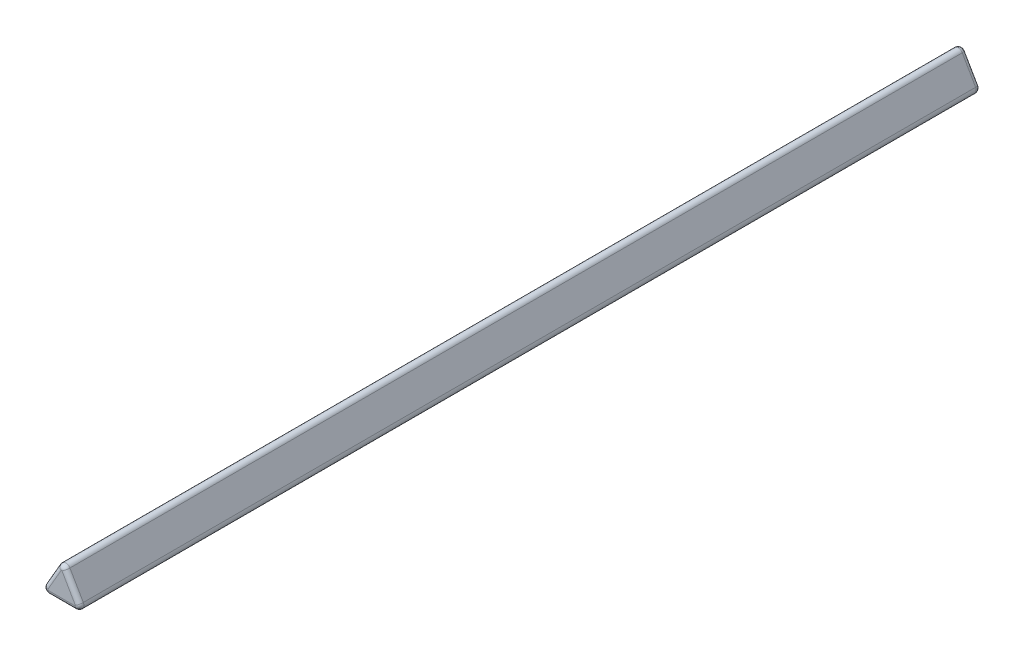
ISO-10303-21;
HEADER;
FILE_DESCRIPTION(('STEP AP214'),'2;1');
FILE_NAME('part.step','',(''),(''),'','','');
FILE_SCHEMA(('AUTOMOTIVE_DESIGN { 1 0 10303 214 1 1 1 1 }'));
ENDSEC;
DATA;
#1=APPLICATION_CONTEXT('core data for automotive mechanical design processes');
#2=APPLICATION_PROTOCOL_DEFINITION('international standard','automotive_design',2000,#1);
#3=PRODUCT_CONTEXT('',#1,'mechanical');
#4=PRODUCT('Part','Part','',(#3));
#5=PRODUCT_RELATED_PRODUCT_CATEGORY('part','',(#4));
#6=PRODUCT_DEFINITION_FORMATION('','',#4);
#7=PRODUCT_DEFINITION_CONTEXT('part definition',#1,'design');
#8=PRODUCT_DEFINITION('design','',#6,#7);
#9=PRODUCT_DEFINITION_SHAPE('','',#8);
#10=(LENGTH_UNIT() NAMED_UNIT(*) SI_UNIT(.MILLI.,.METRE.));
#11=(NAMED_UNIT(*) PLANE_ANGLE_UNIT() SI_UNIT($,.RADIAN.));
#12=(NAMED_UNIT(*) SI_UNIT($,.STERADIAN.) SOLID_ANGLE_UNIT());
#13=UNCERTAINTY_MEASURE_WITH_UNIT(LENGTH_MEASURE(1.E-05),#10,'distance_accuracy_value','');
#14=(GEOMETRIC_REPRESENTATION_CONTEXT(3) GLOBAL_UNCERTAINTY_ASSIGNED_CONTEXT((#13)) GLOBAL_UNIT_ASSIGNED_CONTEXT((#10,
#11,#12)) REPRESENTATION_CONTEXT('',''));
#15=CARTESIAN_POINT('',(0.,0.,0.));
#16=DIRECTION('',(0.,0.,1.));
#17=DIRECTION('',(1.,0.,0.));
#18=AXIS2_PLACEMENT_3D('',#15,#16,#17);
#19=CARTESIAN_POINT('',(1.55884581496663,-0.900000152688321,105.));
#20=DIRECTION('',(0.,0.,-1.));
#21=DIRECTION('',(-1.,0.,0.));
#22=AXIS2_PLACEMENT_3D('',#19,#20,#21);
#23=CYLINDRICAL_SURFACE('',#22,0.549999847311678);
#24=DIRECTION('',(0.,0.,-1.));
#25=VECTOR('',#24,1.);
#26=CARTESIAN_POINT('',(2.03515965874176,-0.625000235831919,105.));
#27=LINE('',#26,#25);
#28=CARTESIAN_POINT('',(2.03515965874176,-0.625000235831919,104.5));
#29=VERTEX_POINT('',#28);
#30=CARTESIAN_POINT('',(2.03515965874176,-0.625000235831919,0.5));
#31=VERTEX_POINT('',#30);
#32=EDGE_CURVE('E134',#29,#31,#27,.T.);
#33=ORIENTED_EDGE('',*,*,#32,.F.);
#34=CARTESIAN_POINT('',(1.55884581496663,-0.900000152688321,104.5));
#35=DIRECTION('',(0.,0.,1.));
#36=DIRECTION('',(1.,0.,0.));
#37=AXIS2_PLACEMENT_3D('',#34,#35,#36);
#38=CIRCLE('',#37,0.549999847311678);
#39=CARTESIAN_POINT('',(1.55884581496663,-1.45,104.5));
#40=VERTEX_POINT('',#39);
#41=EDGE_CURVE('E167',#29,#40,#38,.F.);
#42=ORIENTED_EDGE('',*,*,#41,.T.);
#43=DIRECTION('',(0.,0.,-1.));
#44=VECTOR('',#43,1.);
#45=CARTESIAN_POINT('',(1.55884581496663,-1.45,105.));
#46=LINE('',#45,#44);
#47=CARTESIAN_POINT('',(1.55884581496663,-1.45,0.5));
#48=VERTEX_POINT('',#47);
#49=EDGE_CURVE('E219',#40,#48,#46,.T.);
#50=ORIENTED_EDGE('',*,*,#49,.T.);
#51=CARTESIAN_POINT('',(1.55884581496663,-0.900000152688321,0.5));
#52=DIRECTION('',(0.,0.,1.));
#53=DIRECTION('',(1.,0.,0.));
#54=AXIS2_PLACEMENT_3D('',#51,#52,#53);
#55=CIRCLE('',#54,0.549999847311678);
#56=EDGE_CURVE('E165',#48,#31,#55,.T.);
#57=ORIENTED_EDGE('',*,*,#56,.T.);
#58=EDGE_LOOP('',(#33,#42,#50,#57));
#59=FACE_BOUND('',#58,.T.);
#60=ADVANCED_FACE('F27',(#59),#23,.T.);
#61=CARTESIAN_POINT('',(2.03515965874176,-0.625000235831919,105.));
#62=DIRECTION('',(-0.866025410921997,-0.499999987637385,0.));
#63=DIRECTION('',(0.499999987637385,-0.866025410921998,0.));
#64=AXIS2_PLACEMENT_3D('',#61,#62,#63);
#65=PLANE('',#64);
#66=DIRECTION('',(0.,0.,-1.));
#67=VECTOR('',#66,1.);
#68=CARTESIAN_POINT('',(0.476313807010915,2.07500006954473,105.));
#69=LINE('',#68,#67);
#70=CARTESIAN_POINT('',(0.476313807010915,2.07500006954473,104.5));
#71=VERTEX_POINT('',#70);
#72=CARTESIAN_POINT('',(0.476313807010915,2.07500006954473,0.5));
#73=VERTEX_POINT('',#72);
#74=EDGE_CURVE('E231',#71,#73,#69,.T.);
#75=ORIENTED_EDGE('',*,*,#74,.F.);
#76=DIRECTION('',(-0.499999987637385,0.866025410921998,0.));
#77=VECTOR('',#76,1.);
#78=CARTESIAN_POINT('',(2.03515965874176,-0.625000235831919,104.5));
#79=LINE('',#78,#77);
#80=EDGE_CURVE('E163',#71,#29,#79,.F.);
#81=ORIENTED_EDGE('',*,*,#80,.T.);
#82=ORIENTED_EDGE('',*,*,#32,.T.);
#83=DIRECTION('',(-0.499999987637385,0.866025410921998,0.));
#84=VECTOR('',#83,1.);
#85=CARTESIAN_POINT('',(2.03515965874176,-0.625000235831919,0.5));
#86=LINE('',#85,#84);
#87=EDGE_CURVE('E160',#31,#73,#86,.T.);
#88=ORIENTED_EDGE('',*,*,#87,.T.);
#89=EDGE_LOOP('',(#75,#81,#82,#88));
#90=FACE_BOUND('',#89,.T.);
#91=ADVANCED_FACE('F270',(#90),#65,.F.);
#92=CARTESIAN_POINT('',(-3.67642200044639E-08,1.80000015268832,105.));
#93=DIRECTION('',(0.,0.,-1.));
#94=DIRECTION('',(-1.,0.,0.));
#95=AXIS2_PLACEMENT_3D('',#92,#93,#94);
#96=CYLINDRICAL_SURFACE('',#95,0.549999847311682);
#97=DIRECTION('',(0.,0.,-1.));
#98=VECTOR('',#97,1.);
#99=CARTESIAN_POINT('',(-0.47631388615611,2.07500005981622,105.));
#100=LINE('',#99,#98);
#101=CARTESIAN_POINT('',(-0.47631388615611,2.07500005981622,104.5));
#102=VERTEX_POINT('',#101);
#103=CARTESIAN_POINT('',(-0.47631388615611,2.07500005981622,0.5));
#104=VERTEX_POINT('',#103);
#105=EDGE_CURVE('E228',#102,#104,#100,.T.);
#106=ORIENTED_EDGE('',*,*,#105,.F.);
#107=CARTESIAN_POINT('',(-3.67642200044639E-08,1.80000015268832,104.5));
#108=DIRECTION('',(0.,0.,1.));
#109=DIRECTION('',(1.,0.,0.));
#110=AXIS2_PLACEMENT_3D('',#107,#108,#109);
#111=CIRCLE('',#110,0.549999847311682);
#112=EDGE_CURVE('E158',#102,#71,#111,.F.);
#113=ORIENTED_EDGE('',*,*,#112,.T.);
#114=ORIENTED_EDGE('',*,*,#74,.T.);
#115=CARTESIAN_POINT('',(-3.67642200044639E-08,1.80000015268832,0.5));
#116=DIRECTION('',(0.,0.,1.));
#117=DIRECTION('',(1.,0.,0.));
#118=AXIS2_PLACEMENT_3D('',#115,#116,#117);
#119=CIRCLE('',#118,0.549999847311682);
#120=EDGE_CURVE('E156',#73,#104,#119,.T.);
#121=ORIENTED_EDGE('',*,*,#120,.T.);
#122=EDGE_LOOP('',(#106,#113,#114,#121));
#123=FACE_BOUND('',#122,.T.);
#124=ADVANCED_FACE('F260',(#123),#96,.T.);
#125=CARTESIAN_POINT('',(-0.47631388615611,2.07500005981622,105.));
#126=DIRECTION('',(0.86602542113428,-0.499999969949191,0.));
#127=DIRECTION('',(0.499999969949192,0.86602542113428,0.));
#128=AXIS2_PLACEMENT_3D('',#125,#126,#127);
#129=PLANE('',#128);
#130=DIRECTION('',(0.,0.,-1.));
#131=VECTOR('',#130,1.);
#132=CARTESIAN_POINT('',(-2.03515966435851,-0.625000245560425,105.));
#133=LINE('',#132,#131);
#134=CARTESIAN_POINT('',(-2.03515966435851,-0.625000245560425,104.5));
#135=VERTEX_POINT('',#134);
#136=CARTESIAN_POINT('',(-2.03515966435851,-0.625000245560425,0.5));
#137=VERTEX_POINT('',#136);
#138=EDGE_CURVE('E225',#135,#137,#133,.T.);
#139=ORIENTED_EDGE('',*,*,#138,.F.);
#140=DIRECTION('',(-0.499999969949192,-0.86602542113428,0.));
#141=VECTOR('',#140,1.);
#142=CARTESIAN_POINT('',(-0.47631388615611,2.07500005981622,104.5));
#143=LINE('',#142,#141);
#144=EDGE_CURVE('E154',#135,#102,#143,.F.);
#145=ORIENTED_EDGE('',*,*,#144,.T.);
#146=ORIENTED_EDGE('',*,*,#105,.T.);
#147=DIRECTION('',(-0.499999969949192,-0.86602542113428,0.));
#148=VECTOR('',#147,1.);
#149=CARTESIAN_POINT('',(-0.47631388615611,2.07500005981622,0.5));
#150=LINE('',#149,#148);
#151=EDGE_CURVE('E152',#104,#137,#150,.T.);
#152=ORIENTED_EDGE('',*,*,#151,.T.);
#153=EDGE_LOOP('',(#139,#145,#146,#152));
#154=FACE_BOUND('',#153,.T.);
#155=ADVANCED_FACE('F256',(#154),#129,.F.);
#156=CARTESIAN_POINT('',(-1.55884581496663,-0.900000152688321,105.));
#157=DIRECTION('',(0.,0.,-1.));
#158=DIRECTION('',(-1.,0.,0.));
#159=AXIS2_PLACEMENT_3D('',#156,#157,#158);
#160=CYLINDRICAL_SURFACE('',#159,0.549999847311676);
#161=DIRECTION('',(0.,0.,-1.));
#162=VECTOR('',#161,1.);
#163=CARTESIAN_POINT('',(-1.55884581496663,-1.45,105.));
#164=LINE('',#163,#162);
#165=CARTESIAN_POINT('',(-1.55884581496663,-1.45,104.5));
#166=VERTEX_POINT('',#165);
#167=CARTESIAN_POINT('',(-1.55884581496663,-1.45,0.5));
#168=VERTEX_POINT('',#167);
#169=EDGE_CURVE('E222',#166,#168,#164,.T.);
#170=ORIENTED_EDGE('',*,*,#169,.F.);
#171=CARTESIAN_POINT('',(-1.55884581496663,-0.900000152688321,104.5));
#172=DIRECTION('',(0.,0.,1.));
#173=DIRECTION('',(1.,0.,0.));
#174=AXIS2_PLACEMENT_3D('',#171,#172,#173);
#175=CIRCLE('',#174,0.549999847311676);
#176=EDGE_CURVE('E150',#166,#135,#175,.F.);
#177=ORIENTED_EDGE('',*,*,#176,.T.);
#178=ORIENTED_EDGE('',*,*,#138,.T.);
#179=CARTESIAN_POINT('',(-1.55884581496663,-0.900000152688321,0.5));
#180=DIRECTION('',(0.,0.,1.));
#181=DIRECTION('',(1.,0.,0.));
#182=AXIS2_PLACEMENT_3D('',#179,#180,#181);
#183=CIRCLE('',#182,0.549999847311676);
#184=EDGE_CURVE('E148',#137,#168,#183,.T.);
#185=ORIENTED_EDGE('',*,*,#184,.T.);
#186=EDGE_LOOP('',(#170,#177,#178,#185));
#187=FACE_BOUND('',#186,.T.);
#188=ADVANCED_FACE('F254',(#187),#160,.T.);
#189=CARTESIAN_POINT('',(-1.55884581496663,-1.45,105.));
#190=DIRECTION('',(0.,1.,0.));
#191=DIRECTION('',(-1.,0.,0.));
#192=AXIS2_PLACEMENT_3D('',#189,#190,#191);
#193=PLANE('',#192);
#194=ORIENTED_EDGE('',*,*,#49,.F.);
#195=DIRECTION('',(1.,0.,0.));
#196=VECTOR('',#195,1.);
#197=CARTESIAN_POINT('',(-1.55884581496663,-1.45,104.5));
#198=LINE('',#197,#196);
#199=EDGE_CURVE('E120',#40,#166,#198,.F.);
#200=ORIENTED_EDGE('',*,*,#199,.T.);
#201=ORIENTED_EDGE('',*,*,#169,.T.);
#202=DIRECTION('',(1.,0.,0.));
#203=VECTOR('',#202,1.);
#204=CARTESIAN_POINT('',(-1.55884581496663,-1.45,0.5));
#205=LINE('',#204,#203);
#206=EDGE_CURVE('E140',#168,#48,#205,.T.);
#207=ORIENTED_EDGE('',*,*,#206,.T.);
#208=EDGE_LOOP('',(#194,#200,#201,#207));
#209=FACE_BOUND('',#208,.T.);
#210=ADVANCED_FACE('F253',(#209),#193,.F.);
#211=CARTESIAN_POINT('',(1.55884581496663,-0.900000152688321,105.));
#212=DIRECTION('',(0.,0.,1.));
#213=DIRECTION('',(1.,0.,0.));
#214=AXIS2_PLACEMENT_3D('',#211,#212,#213);
#215=PLANE('',#214);
#216=CARTESIAN_POINT('',(-1.55884581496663,-0.900000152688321,105.));
#217=DIRECTION('',(0.,0.,1.));
#218=DIRECTION('',(1.,0.,0.));
#219=AXIS2_PLACEMENT_3D('',#216,#217,#218);
#220=CIRCLE('',#219,0.0499998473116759);
#221=CARTESIAN_POINT('',(-1.60214695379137,-0.875000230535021,105.));
#222=VERTEX_POINT('',#221);
#223=CARTESIAN_POINT('',(-1.55884581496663,-0.949999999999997,105.));
#224=VERTEX_POINT('',#223);
#225=EDGE_CURVE('E138',#222,#224,#220,.T.);
#226=ORIENTED_EDGE('',*,*,#225,.T.);
#227=DIRECTION('',(1.,0.,0.));
#228=VECTOR('',#227,1.);
#229=CARTESIAN_POINT('',(1.55884581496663,-0.95,105.));
#230=LINE('',#229,#228);
#231=CARTESIAN_POINT('',(1.55884581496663,-0.949999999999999,105.));
#232=VERTEX_POINT('',#231);
#233=EDGE_CURVE('E118',#224,#232,#230,.T.);
#234=ORIENTED_EDGE('',*,*,#233,.T.);
#235=CARTESIAN_POINT('',(1.55884581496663,-0.900000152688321,105.));
#236=DIRECTION('',(0.,0.,1.));
#237=DIRECTION('',(1.,0.,0.));
#238=AXIS2_PLACEMENT_3D('',#235,#236,#237);
#239=CIRCLE('',#238,0.0499998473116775);
#240=CARTESIAN_POINT('',(1.60214695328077,-0.875000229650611,105.));
#241=VERTEX_POINT('',#240);
#242=EDGE_CURVE('E127',#232,#241,#239,.T.);
#243=ORIENTED_EDGE('',*,*,#242,.T.);
#244=DIRECTION('',(-0.499999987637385,0.866025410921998,0.));
#245=VECTOR('',#244,1.);
#246=CARTESIAN_POINT('',(0.043301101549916,1.82500007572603,105.));
#247=LINE('',#246,#245);
#248=CARTESIAN_POINT('',(0.0433011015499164,1.82500007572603,105.));
#249=VERTEX_POINT('',#248);
#250=EDGE_CURVE('E133',#241,#249,#247,.T.);
#251=ORIENTED_EDGE('',*,*,#250,.T.);
#252=CARTESIAN_POINT('',(-3.67642200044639E-08,1.80000015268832,105.));
#253=DIRECTION('',(0.,0.,1.));
#254=DIRECTION('',(1.,0.,0.));
#255=AXIS2_PLACEMENT_3D('',#252,#253,#254);
#256=CIRCLE('',#255,0.0499998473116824);
#257=CARTESIAN_POINT('',(-0.0433011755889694,1.82500007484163,105.));
#258=VERTEX_POINT('',#257);
#259=EDGE_CURVE('E237',#249,#258,#256,.T.);
#260=ORIENTED_EDGE('',*,*,#259,.T.);
#261=DIRECTION('',(-0.499999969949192,-0.86602542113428,0.));
#262=VECTOR('',#261,1.);
#263=CARTESIAN_POINT('',(-1.60214695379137,-0.875000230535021,105.));
#264=LINE('',#263,#262);
#265=EDGE_CURVE('E143',#258,#222,#264,.T.);
#266=ORIENTED_EDGE('',*,*,#265,.T.);
#267=EDGE_LOOP('',(#226,#234,#243,#251,#260,#266));
#268=FACE_BOUND('',#267,.T.);
#269=ADVANCED_FACE('F136',(#268),#215,.T.);
#270=CARTESIAN_POINT('',(1.55884581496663,-0.900000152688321,0.));
#271=DIRECTION('',(0.,0.,1.));
#272=DIRECTION('',(1.,0.,0.));
#273=AXIS2_PLACEMENT_3D('',#270,#271,#272);
#274=PLANE('',#273);
#275=CARTESIAN_POINT('',(-3.67642200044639E-08,1.80000015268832,0.));
#276=DIRECTION('',(0.,0.,1.));
#277=DIRECTION('',(1.,0.,0.));
#278=AXIS2_PLACEMENT_3D('',#275,#276,#277);
#279=CIRCLE('',#278,0.0499998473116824);
#280=CARTESIAN_POINT('',(-0.0433011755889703,1.82500007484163,0.));
#281=VERTEX_POINT('',#280);
#282=CARTESIAN_POINT('',(0.0433011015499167,1.82500007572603,0.));
#283=VERTEX_POINT('',#282);
#284=EDGE_CURVE('E34',#281,#283,#279,.F.);
#285=ORIENTED_EDGE('',*,*,#284,.T.);
#286=DIRECTION('',(-0.499999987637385,0.866025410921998,0.));
#287=VECTOR('',#286,1.);
#288=CARTESIAN_POINT('',(1.60214695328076,-0.875000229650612,0.));
#289=LINE('',#288,#287);
#290=CARTESIAN_POINT('',(1.60214695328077,-0.875000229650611,0.));
#291=VERTEX_POINT('',#290);
#292=EDGE_CURVE('E11',#283,#291,#289,.F.);
#293=ORIENTED_EDGE('',*,*,#292,.T.);
#294=CARTESIAN_POINT('',(1.55884581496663,-0.900000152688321,0.));
#295=DIRECTION('',(0.,0.,1.));
#296=DIRECTION('',(1.,0.,0.));
#297=AXIS2_PLACEMENT_3D('',#294,#295,#296);
#298=CIRCLE('',#297,0.0499998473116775);
#299=CARTESIAN_POINT('',(1.55884581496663,-0.949999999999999,0.));
#300=VERTEX_POINT('',#299);
#301=EDGE_CURVE('E169',#291,#300,#298,.F.);
#302=ORIENTED_EDGE('',*,*,#301,.T.);
#303=DIRECTION('',(1.,0.,0.));
#304=VECTOR('',#303,1.);
#305=CARTESIAN_POINT('',(1.55884581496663,-0.95,0.));
#306=LINE('',#305,#304);
#307=CARTESIAN_POINT('',(-1.55884581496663,-0.95,0.));
#308=VERTEX_POINT('',#307);
#309=EDGE_CURVE('E171',#300,#308,#306,.F.);
#310=ORIENTED_EDGE('',*,*,#309,.T.);
#311=CARTESIAN_POINT('',(-1.55884581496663,-0.900000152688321,0.));
#312=DIRECTION('',(0.,0.,1.));
#313=DIRECTION('',(1.,0.,0.));
#314=AXIS2_PLACEMENT_3D('',#311,#312,#313);
#315=CIRCLE('',#314,0.0499998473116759);
#316=CARTESIAN_POINT('',(-1.60214695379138,-0.875000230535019,0.));
#317=VERTEX_POINT('',#316);
#318=EDGE_CURVE('E173',#308,#317,#315,.F.);
#319=ORIENTED_EDGE('',*,*,#318,.T.);
#320=DIRECTION('',(-0.499999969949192,-0.86602542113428,0.));
#321=VECTOR('',#320,1.);
#322=CARTESIAN_POINT('',(-0.82272413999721,0.474999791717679,0.));
#323=LINE('',#322,#321);
#324=EDGE_CURVE('E44',#317,#281,#323,.F.);
#325=ORIENTED_EDGE('',*,*,#324,.T.);
#326=EDGE_LOOP('',(#285,#293,#302,#310,#319,#325));
#327=FACE_BOUND('',#326,.T.);
#328=ADVANCED_FACE('F177',(#327),#274,.F.);
#329=CARTESIAN_POINT('',(-3.67642200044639E-08,1.80000015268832,104.5));
#330=DIRECTION('',(0.,0.,1.));
#331=DIRECTION('',(1.,0.,0.));
#332=AXIS2_PLACEMENT_3D('',#329,#330,#331);
#333=DEGENERATE_TOROIDAL_SURFACE('',#332,0.0499998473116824,0.5,.T.);
#334=CARTESIAN_POINT('',(0.0433011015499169,1.82500007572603,104.5));
#335=DIRECTION('',(0.499999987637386,-0.866025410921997,0.));
#336=DIRECTION('',(0.866025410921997,0.499999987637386,0.));
#337=AXIS2_PLACEMENT_3D('',#334,#335,#336);
#338=CIRCLE('',#337,0.5);
#339=EDGE_CURVE('E213',#71,#249,#338,.T.);
#340=ORIENTED_EDGE('',*,*,#339,.F.);
#341=ORIENTED_EDGE('',*,*,#112,.F.);
#342=CARTESIAN_POINT('',(-0.0433011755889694,1.82500007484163,104.5));
#343=DIRECTION('',(-0.499999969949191,-0.86602542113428,0.));
#344=DIRECTION('',(0.86602542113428,-0.499999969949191,0.));
#345=AXIS2_PLACEMENT_3D('',#342,#343,#344);
#346=CIRCLE('',#345,0.5);
#347=EDGE_CURVE('E216',#258,#102,#346,.T.);
#348=ORIENTED_EDGE('',*,*,#347,.F.);
#349=ORIENTED_EDGE('',*,*,#259,.F.);
#350=EDGE_LOOP('',(#340,#341,#348,#349));
#351=FACE_BOUND('',#350,.T.);
#352=ADVANCED_FACE('F264',(#351),#333,.T.);
#353=CARTESIAN_POINT('',(-0.822724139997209,0.474999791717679,104.5));
#354=DIRECTION('',(0.499999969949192,0.86602542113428,0.));
#355=DIRECTION('',(-0.86602542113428,0.499999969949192,0.));
#356=AXIS2_PLACEMENT_3D('',#353,#354,#355);
#357=CYLINDRICAL_SURFACE('',#356,0.5);
#358=ORIENTED_EDGE('',*,*,#347,.T.);
#359=ORIENTED_EDGE('',*,*,#144,.F.);
#360=CARTESIAN_POINT('',(-1.60214695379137,-0.875000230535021,104.5));
#361=DIRECTION('',(-0.499999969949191,-0.866025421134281,0.));
#362=DIRECTION('',(0.866025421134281,-0.499999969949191,0.));
#363=AXIS2_PLACEMENT_3D('',#360,#361,#362);
#364=CIRCLE('',#363,0.5);
#365=EDGE_CURVE('E210',#222,#135,#364,.T.);
#366=ORIENTED_EDGE('',*,*,#365,.F.);
#367=ORIENTED_EDGE('',*,*,#265,.F.);
#368=EDGE_LOOP('',(#358,#359,#366,#367));
#369=FACE_BOUND('',#368,.T.);
#370=ADVANCED_FACE('F244',(#369),#357,.T.);
#371=CARTESIAN_POINT('',(1.60214695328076,-0.875000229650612,104.5));
#372=DIRECTION('',(0.499999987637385,-0.866025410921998,0.));
#373=DIRECTION('',(0.866025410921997,0.499999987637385,0.));
#374=AXIS2_PLACEMENT_3D('',#371,#372,#373);
#375=CYLINDRICAL_SURFACE('',#374,0.5);
#376=ORIENTED_EDGE('',*,*,#339,.T.);
#377=ORIENTED_EDGE('',*,*,#250,.F.);
#378=CARTESIAN_POINT('',(1.60214695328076,-0.875000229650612,104.5));
#379=DIRECTION('',(0.499999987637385,-0.866025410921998,0.));
#380=DIRECTION('',(0.866025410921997,0.499999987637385,0.));
#381=AXIS2_PLACEMENT_3D('',#378,#379,#380);
#382=CIRCLE('',#381,0.5);
#383=EDGE_CURVE('E130',#29,#241,#382,.T.);
#384=ORIENTED_EDGE('',*,*,#383,.F.);
#385=ORIENTED_EDGE('',*,*,#80,.F.);
#386=EDGE_LOOP('',(#376,#377,#384,#385));
#387=FACE_BOUND('',#386,.T.);
#388=ADVANCED_FACE('F267',(#387),#375,.T.);
#389=CARTESIAN_POINT('',(-1.55884581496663,-0.900000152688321,104.5));
#390=DIRECTION('',(0.,0.,1.));
#391=DIRECTION('',(1.,0.,0.));
#392=AXIS2_PLACEMENT_3D('',#389,#390,#391);
#393=DEGENERATE_TOROIDAL_SURFACE('',#392,0.0499998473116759,0.5,.T.);
#394=ORIENTED_EDGE('',*,*,#365,.T.);
#395=ORIENTED_EDGE('',*,*,#176,.F.);
#396=CARTESIAN_POINT('',(-1.55884581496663,-0.949999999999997,104.5));
#397=DIRECTION('',(1.,0.,0.));
#398=DIRECTION('',(0.,0.,-1.));
#399=AXIS2_PLACEMENT_3D('',#396,#397,#398);
#400=CIRCLE('',#399,0.5);
#401=EDGE_CURVE('E123',#224,#166,#400,.T.);
#402=ORIENTED_EDGE('',*,*,#401,.F.);
#403=ORIENTED_EDGE('',*,*,#225,.F.);
#404=EDGE_LOOP('',(#394,#395,#402,#403));
#405=FACE_BOUND('',#404,.T.);
#406=ADVANCED_FACE('F247',(#405),#393,.T.);
#407=CARTESIAN_POINT('',(1.55884581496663,-0.900000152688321,104.5));
#408=DIRECTION('',(0.,0.,1.));
#409=DIRECTION('',(1.,0.,0.));
#410=AXIS2_PLACEMENT_3D('',#407,#408,#409);
#411=DEGENERATE_TOROIDAL_SURFACE('',#410,0.0499998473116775,0.5,.T.);
#412=ORIENTED_EDGE('',*,*,#383,.T.);
#413=ORIENTED_EDGE('',*,*,#242,.F.);
#414=CARTESIAN_POINT('',(1.55884581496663,-0.949999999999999,104.5));
#415=DIRECTION('',(-1.,0.,0.));
#416=DIRECTION('',(0.,0.,1.));
#417=AXIS2_PLACEMENT_3D('',#414,#415,#416);
#418=CIRCLE('',#417,0.5);
#419=EDGE_CURVE('E114',#40,#232,#418,.T.);
#420=ORIENTED_EDGE('',*,*,#419,.F.);
#421=ORIENTED_EDGE('',*,*,#41,.F.);
#422=EDGE_LOOP('',(#412,#413,#420,#421));
#423=FACE_BOUND('',#422,.T.);
#424=ADVANCED_FACE('F128',(#423),#411,.T.);
#425=CARTESIAN_POINT('',(1.55884581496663,-0.95,104.5));
#426=DIRECTION('',(-1.,0.,0.));
#427=DIRECTION('',(0.,-1.,0.));
#428=AXIS2_PLACEMENT_3D('',#425,#426,#427);
#429=CYLINDRICAL_SURFACE('',#428,0.5);
#430=ORIENTED_EDGE('',*,*,#401,.T.);
#431=ORIENTED_EDGE('',*,*,#199,.F.);
#432=ORIENTED_EDGE('',*,*,#419,.T.);
#433=ORIENTED_EDGE('',*,*,#233,.F.);
#434=EDGE_LOOP('',(#430,#431,#432,#433));
#435=FACE_BOUND('',#434,.T.);
#436=ADVANCED_FACE('F116',(#435),#429,.T.);
#437=CARTESIAN_POINT('',(-1.55884581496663,-0.900000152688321,0.5));
#438=DIRECTION('',(0.,0.,1.));
#439=DIRECTION('',(1.,0.,0.));
#440=AXIS2_PLACEMENT_3D('',#437,#438,#439);
#441=DEGENERATE_TOROIDAL_SURFACE('',#440,0.0499998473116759,0.5,.T.);
#442=CARTESIAN_POINT('',(-1.60214695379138,-0.875000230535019,0.5));
#443=DIRECTION('',(0.499999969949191,0.86602542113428,0.));
#444=DIRECTION('',(-0.86602542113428,0.499999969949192,0.));
#445=AXIS2_PLACEMENT_3D('',#442,#443,#444);
#446=CIRCLE('',#445,0.5);
#447=EDGE_CURVE('E184',#317,#137,#446,.T.);
#448=ORIENTED_EDGE('',*,*,#447,.F.);
#449=ORIENTED_EDGE('',*,*,#318,.F.);
#450=CARTESIAN_POINT('',(-1.55884581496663,-0.949999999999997,0.5));
#451=DIRECTION('',(1.,0.,0.));
#452=DIRECTION('',(0.,0.,-1.));
#453=AXIS2_PLACEMENT_3D('',#450,#451,#452);
#454=CIRCLE('',#453,0.5);
#455=EDGE_CURVE('E124',#168,#308,#454,.T.);
#456=ORIENTED_EDGE('',*,*,#455,.F.);
#457=ORIENTED_EDGE('',*,*,#184,.F.);
#458=EDGE_LOOP('',(#448,#449,#456,#457));
#459=FACE_BOUND('',#458,.T.);
#460=ADVANCED_FACE('F185',(#459),#441,.T.);
#461=CARTESIAN_POINT('',(-1.55884581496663,-0.95,0.5));
#462=DIRECTION('',(1.,0.,0.));
#463=DIRECTION('',(0.,1.,0.));
#464=AXIS2_PLACEMENT_3D('',#461,#462,#463);
#465=CYLINDRICAL_SURFACE('',#464,0.5);
#466=ORIENTED_EDGE('',*,*,#455,.T.);
#467=ORIENTED_EDGE('',*,*,#309,.F.);
#468=CARTESIAN_POINT('',(1.55884581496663,-0.95,0.5));
#469=DIRECTION('',(1.,0.,0.));
#470=DIRECTION('',(0.,0.,-1.));
#471=AXIS2_PLACEMENT_3D('',#468,#469,#470);
#472=CIRCLE('',#471,0.5);
#473=EDGE_CURVE('E188',#48,#300,#472,.T.);
#474=ORIENTED_EDGE('',*,*,#473,.F.);
#475=ORIENTED_EDGE('',*,*,#206,.F.);
#476=EDGE_LOOP('',(#466,#467,#474,#475));
#477=FACE_BOUND('',#476,.T.);
#478=ADVANCED_FACE('F318',(#477),#465,.T.);
#479=CARTESIAN_POINT('',(-0.0433011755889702,1.82500007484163,0.5));
#480=DIRECTION('',(-0.499999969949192,-0.86602542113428,0.));
#481=DIRECTION('',(0.86602542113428,-0.499999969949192,0.));
#482=AXIS2_PLACEMENT_3D('',#479,#480,#481);
#483=CYLINDRICAL_SURFACE('',#482,0.5);
#484=ORIENTED_EDGE('',*,*,#447,.T.);
#485=ORIENTED_EDGE('',*,*,#151,.F.);
#486=CARTESIAN_POINT('',(-0.0433011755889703,1.82500007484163,0.5));
#487=DIRECTION('',(0.499999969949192,0.86602542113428,0.));
#488=DIRECTION('',(-0.86602542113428,0.499999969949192,0.));
#489=AXIS2_PLACEMENT_3D('',#486,#487,#488);
#490=CIRCLE('',#489,0.5);
#491=EDGE_CURVE('E192',#281,#104,#490,.T.);
#492=ORIENTED_EDGE('',*,*,#491,.F.);
#493=ORIENTED_EDGE('',*,*,#324,.F.);
#494=EDGE_LOOP('',(#484,#485,#492,#493));
#495=FACE_BOUND('',#494,.T.);
#496=ADVANCED_FACE('F190',(#495),#483,.T.);
#497=CARTESIAN_POINT('',(1.55884581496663,-0.900000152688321,0.5));
#498=DIRECTION('',(0.,0.,1.));
#499=DIRECTION('',(1.,0.,0.));
#500=AXIS2_PLACEMENT_3D('',#497,#498,#499);
#501=DEGENERATE_TOROIDAL_SURFACE('',#500,0.0499998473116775,0.5,.T.);
#502=ORIENTED_EDGE('',*,*,#473,.T.);
#503=ORIENTED_EDGE('',*,*,#301,.F.);
#504=CARTESIAN_POINT('',(1.60214695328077,-0.875000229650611,0.5));
#505=DIRECTION('',(-0.499999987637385,0.866025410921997,0.));
#506=DIRECTION('',(-0.866025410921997,-0.499999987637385,0.));
#507=AXIS2_PLACEMENT_3D('',#504,#505,#506);
#508=CIRCLE('',#507,0.5);
#509=EDGE_CURVE('E195',#31,#291,#508,.T.);
#510=ORIENTED_EDGE('',*,*,#509,.F.);
#511=ORIENTED_EDGE('',*,*,#56,.F.);
#512=EDGE_LOOP('',(#502,#503,#510,#511));
#513=FACE_BOUND('',#512,.T.);
#514=ADVANCED_FACE('F276',(#513),#501,.T.);
#515=CARTESIAN_POINT('',(-3.67642200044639E-08,1.80000015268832,0.5));
#516=DIRECTION('',(0.,0.,1.));
#517=DIRECTION('',(1.,0.,0.));
#518=AXIS2_PLACEMENT_3D('',#515,#516,#517);
#519=DEGENERATE_TOROIDAL_SURFACE('',#518,0.0499998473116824,0.5,.T.);
#520=ORIENTED_EDGE('',*,*,#491,.T.);
#521=ORIENTED_EDGE('',*,*,#120,.F.);
#522=CARTESIAN_POINT('',(0.0433011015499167,1.82500007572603,0.5));
#523=DIRECTION('',(0.499999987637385,-0.866025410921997,0.));
#524=DIRECTION('',(0.866025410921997,0.499999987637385,0.));
#525=AXIS2_PLACEMENT_3D('',#522,#523,#524);
#526=CIRCLE('',#525,0.5);
#527=EDGE_CURVE('E199',#283,#73,#526,.T.);
#528=ORIENTED_EDGE('',*,*,#527,.F.);
#529=ORIENTED_EDGE('',*,*,#284,.F.);
#530=EDGE_LOOP('',(#520,#521,#528,#529));
#531=FACE_BOUND('',#530,.T.);
#532=ADVANCED_FACE('F198',(#531),#519,.T.);
#533=CARTESIAN_POINT('',(1.60214695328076,-0.875000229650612,0.5));
#534=DIRECTION('',(-0.499999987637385,0.866025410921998,0.));
#535=DIRECTION('',(-0.866025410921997,-0.499999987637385,0.));
#536=AXIS2_PLACEMENT_3D('',#533,#534,#535);
#537=CYLINDRICAL_SURFACE('',#536,0.5);
#538=ORIENTED_EDGE('',*,*,#509,.T.);
#539=ORIENTED_EDGE('',*,*,#292,.F.);
#540=ORIENTED_EDGE('',*,*,#527,.T.);
#541=ORIENTED_EDGE('',*,*,#87,.F.);
#542=EDGE_LOOP('',(#538,#539,#540,#541));
#543=FACE_BOUND('',#542,.T.);
#544=ADVANCED_FACE('F278',(#543),#537,.T.);
#545=CLOSED_SHELL('',(#60,#91,#124,#155,#188,#210,#269,#328,#352,#370,#388,#406,#424,#436,#460,
#478,#496,#514,#532,#544));
#546=MANIFOLD_SOLID_BREP('B2',#545);
#547=ADVANCED_BREP_SHAPE_REPRESENTATION('',(#18,#546),#14);
#548=SHAPE_DEFINITION_REPRESENTATION(#9,#547);
ENDSEC;
END-ISO-10303-21;
